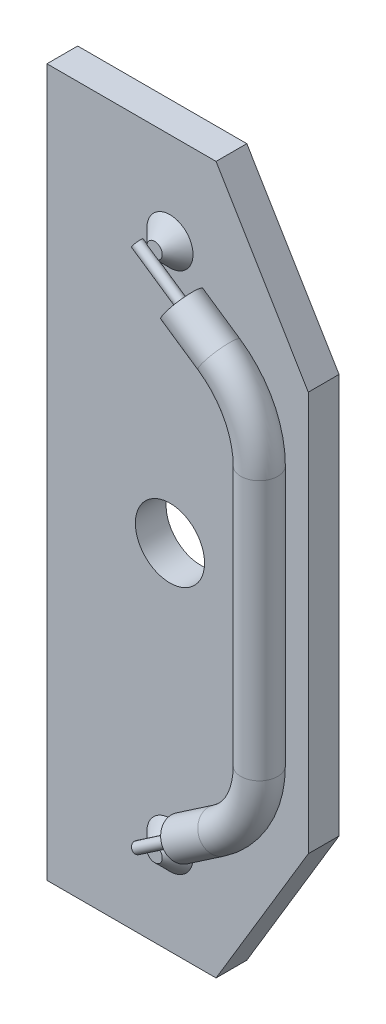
ISO-10303-21;
HEADER;
FILE_DESCRIPTION(('STEP AP214'),'2;1');
FILE_NAME('part.step','',(''),(''),'','','');
FILE_SCHEMA(('AUTOMOTIVE_DESIGN { 1 0 10303 214 1 1 1 1 }'));
ENDSEC;
DATA;
#1=APPLICATION_CONTEXT('core data for automotive mechanical design processes');
#2=APPLICATION_PROTOCOL_DEFINITION('international standard','automotive_design',2000,#1);
#3=PRODUCT_CONTEXT('',#1,'mechanical');
#4=PRODUCT('Part','Part','',(#3));
#5=PRODUCT_RELATED_PRODUCT_CATEGORY('part','',(#4));
#6=PRODUCT_DEFINITION_FORMATION('','',#4);
#7=PRODUCT_DEFINITION_CONTEXT('part definition',#1,'design');
#8=PRODUCT_DEFINITION('design','',#6,#7);
#9=PRODUCT_DEFINITION_SHAPE('','',#8);
#10=(LENGTH_UNIT() NAMED_UNIT(*) SI_UNIT(.MILLI.,.METRE.));
#11=(NAMED_UNIT(*) PLANE_ANGLE_UNIT() SI_UNIT($,.RADIAN.));
#12=(NAMED_UNIT(*) SI_UNIT($,.STERADIAN.) SOLID_ANGLE_UNIT());
#13=UNCERTAINTY_MEASURE_WITH_UNIT(LENGTH_MEASURE(1.E-05),#10,'distance_accuracy_value','');
#14=(GEOMETRIC_REPRESENTATION_CONTEXT(3) GLOBAL_UNCERTAINTY_ASSIGNED_CONTEXT((#13)) GLOBAL_UNIT_ASSIGNED_CONTEXT((#10,
#11,#12)) REPRESENTATION_CONTEXT('',''));
#15=CARTESIAN_POINT('',(0.,0.,0.));
#16=DIRECTION('',(0.,0.,1.));
#17=DIRECTION('',(1.,0.,0.));
#18=AXIS2_PLACEMENT_3D('',#15,#16,#17);
#19=CARTESIAN_POINT('',(0.,17.,2.00000000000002));
#20=DIRECTION('',(0.,0.,-1.));
#21=DIRECTION('',(1.,0.,0.));
#22=AXIS2_PLACEMENT_3D('',#19,#20,#21);
#23=CONICAL_SURFACE('',#22,1.5,0.78539816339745);
#24=CARTESIAN_POINT('',(0.,17.,2.00000000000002));
#25=DIRECTION('',(0.,0.,1.));
#26=DIRECTION('',(1.,0.,0.));
#27=AXIS2_PLACEMENT_3D('',#24,#25,#26);
#28=CIRCLE('',#27,1.5);
#29=CARTESIAN_POINT('',(1.50000000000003,17.,2.00000000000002));
#30=VERTEX_POINT('',#29);
#31=EDGE_CURVE('E365',#30,#30,#28,.T.);
#32=ORIENTED_EDGE('',*,*,#31,.T.);
#33=EDGE_LOOP('',(#32));
#34=FACE_BOUND('',#33,.T.);
#35=CARTESIAN_POINT('',(-0.495942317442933,17.0619778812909,3.00020000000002));
#36=CARTESIAN_POINT('',(-0.505048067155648,17.0606807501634,2.9913161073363));
#37=CARTESIAN_POINT('',(-0.51418508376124,17.0586686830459,2.98249000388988));
#38=CARTESIAN_POINT('',(-0.532331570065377,17.0529090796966,2.96506207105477));
#39=CARTESIAN_POINT('',(-0.541338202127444,17.049141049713,2.9564641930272));
#40=CARTESIAN_POINT('',(-0.557374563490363,17.0403626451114,2.94118396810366));
#41=CARTESIAN_POINT('',(-0.56448684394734,17.0356558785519,2.93441818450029));
#42=CARTESIAN_POINT('',(-0.578003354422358,17.0247105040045,2.92149792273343));
#43=CARTESIAN_POINT('',(-0.584410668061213,17.0184789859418,2.91534079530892));
#44=CARTESIAN_POINT('',(-0.595306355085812,17.005517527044,2.90469866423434));
#45=CARTESIAN_POINT('',(-0.599938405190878,16.9990015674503,2.90010130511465));
#46=CARTESIAN_POINT('',(-0.60823302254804,16.9849578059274,2.89162078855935));
#47=CARTESIAN_POINT('',(-0.611895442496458,16.9774298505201,2.88773773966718));
#48=CARTESIAN_POINT('',(-0.618088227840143,16.9615908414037,2.88076792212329));
#49=CARTESIAN_POINT('',(-0.620619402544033,16.9532803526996,2.8776805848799));
#50=CARTESIAN_POINT('',(-0.624506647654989,16.9361480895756,2.87229343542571));
#51=CARTESIAN_POINT('',(-0.62586202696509,16.9273260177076,2.86999408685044));
#52=CARTESIAN_POINT('',(-0.627699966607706,16.9065748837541,2.86549058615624));
#53=CARTESIAN_POINT('',(-0.627766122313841,16.8945525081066,2.86355083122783));
#54=CARTESIAN_POINT('',(-0.626205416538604,16.8705018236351,2.86065761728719));
#55=CARTESIAN_POINT('',(-0.624574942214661,16.8584735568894,2.8597062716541));
#56=CARTESIAN_POINT('',(-0.618622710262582,16.8280378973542,2.85819746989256));
#57=CARTESIAN_POINT('',(-0.613308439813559,16.8098036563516,2.8581534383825));
#58=CARTESIAN_POINT('',(-0.600195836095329,16.7742899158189,2.85904853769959));
#59=CARTESIAN_POINT('',(-0.592391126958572,16.7570130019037,2.85999020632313));
#60=CARTESIAN_POINT('',(-0.568409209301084,16.7110383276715,2.86320426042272));
#61=CARTESIAN_POINT('',(-0.550316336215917,16.6833771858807,2.86594559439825));
#62=CARTESIAN_POINT('',(-0.510226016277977,16.6310586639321,2.87122097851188));
#63=CARTESIAN_POINT('',(-0.488220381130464,16.6064077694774,2.87375457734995));
#64=CARTESIAN_POINT('',(-0.433136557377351,16.5520273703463,2.87844562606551));
#65=CARTESIAN_POINT('',(-0.39885450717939,16.523470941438,2.88017332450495));
#66=CARTESIAN_POINT('',(-0.326297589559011,16.4719278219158,2.88084757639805));
#67=CARTESIAN_POINT('',(-0.288021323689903,16.4489430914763,2.87979315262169));
#68=CARTESIAN_POINT('',(-0.216995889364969,16.413802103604,2.87589935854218));
#69=CARTESIAN_POINT('',(-0.184843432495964,16.4003788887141,2.87349569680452));
#70=CARTESIAN_POINT('',(-0.118966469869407,16.3784649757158,2.86812330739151));
#71=CARTESIAN_POINT('',(-0.0852473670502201,16.3699585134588,2.8651564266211));
#72=CARTESIAN_POINT('',(-0.0340782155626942,16.3621757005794,2.86149458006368));
#73=CARTESIAN_POINT('',(-0.0170320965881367,16.3604067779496,2.86040976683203));
#74=CARTESIAN_POINT('',(0.0171993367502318,16.3588227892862,2.85881978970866));
#75=CARTESIAN_POINT('',(0.0343846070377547,16.3590071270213,2.85831444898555));
#76=CARTESIAN_POINT('',(0.0653122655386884,16.3615194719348,2.85833794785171));
#77=CARTESIAN_POINT('',(0.079086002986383,16.3634318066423,2.85868788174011));
#78=CARTESIAN_POINT('',(0.106181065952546,16.369131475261,2.86040629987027));
#79=CARTESIAN_POINT('',(0.1195033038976,16.3729147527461,2.86177258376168));
#80=CARTESIAN_POINT('',(0.141502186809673,16.3812292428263,2.86533044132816));
#81=CARTESIAN_POINT('',(0.150426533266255,16.3852457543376,2.86717901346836));
#82=CARTESIAN_POINT('',(0.167451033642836,16.3943904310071,2.87173653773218));
#83=CARTESIAN_POINT('',(0.17555201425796,16.3995174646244,2.87444461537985));
#84=CARTESIAN_POINT('',(0.190653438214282,16.4108312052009,2.88081576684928));
#85=CARTESIAN_POINT('',(0.197646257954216,16.4170246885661,2.88448503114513));
#86=CARTESIAN_POINT('',(0.210186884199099,16.43021390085,2.89273668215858));
#87=CARTESIAN_POINT('',(0.215734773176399,16.4372095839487,2.89731901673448));
#88=CARTESIAN_POINT('',(0.224835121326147,16.4510292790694,2.90680712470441));
#89=CARTESIAN_POINT('',(0.228522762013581,16.4578114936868,2.91164605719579));
#90=CARTESIAN_POINT('',(0.234644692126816,16.4715565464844,2.92183052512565));
#91=CARTESIAN_POINT('',(0.237078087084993,16.4785195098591,2.92717641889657));
#92=CARTESIAN_POINT('',(0.241674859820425,16.4957429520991,2.94086207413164));
#93=CARTESIAN_POINT('',(0.243166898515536,16.5060063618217,2.94942254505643));
#94=CARTESIAN_POINT('',(0.244099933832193,16.5261884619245,2.96702965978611));
#95=CARTESIAN_POINT('',(0.24353785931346,16.5361066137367,2.97607701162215));
#96=CARTESIAN_POINT('',(0.241396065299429,16.5509776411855,2.99020523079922));
#97=CARTESIAN_POINT('',(0.240405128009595,16.5561111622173,2.99519133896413));
#98=CARTESIAN_POINT('',(0.239204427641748,16.5611591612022,3.00020000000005));
#99=B_SPLINE_CURVE_WITH_KNOTS('',3,(#35,#36,#37,#38,#39,#40,#41,#42,#43,#44,#45,#46,#47,#48,#49,
#50,#51,#52,#53,#54,#55,#56,#57,#58,#59,#60,#61,#62,#63,#64,#65,#66,#67,#68,#69,#70,#71,#72,#73,
#74,#75,#76,#77,#78,#79,#80,#81,#82,#83,#84,#85,#86,#87,#88,#89,#90,#91,#92,#93,#94,#95,#96,#97,
#98),.UNSPECIFIED.,.F.,.F.,(4,2,2,2,2,2,2,2,2,2,2,2,2,2,2,2,2,2,2,2,2,2,2,2,2,2,2,2,2,2,2,4),
(0.,0.038429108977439,0.0773184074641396,0.109853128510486,0.142239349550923,0.169781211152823,
0.197327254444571,0.22485355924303,0.252396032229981,0.288725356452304,0.325132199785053,
0.381789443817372,0.438592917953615,0.537539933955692,0.636696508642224,0.769988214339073,
0.903326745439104,1.00780673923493,1.11194986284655,1.1633804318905,1.21479530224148,
1.25640138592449,1.29791765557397,1.32768429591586,1.35742074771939,1.38735363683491,
1.41728481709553,1.44450620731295,1.47174698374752,1.51186417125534,1.55204136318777,
1.57369176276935),.UNSPECIFIED.);
#100=CARTESIAN_POINT('',(-0.496147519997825,17.0619486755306,3.00000000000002));
#101=VERTEX_POINT('',#100);
#102=CARTESIAN_POINT('',(0.239252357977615,16.5609575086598,3.00000000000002));
#103=VERTEX_POINT('',#102);
#104=EDGE_CURVE('E53',#101,#103,#99,.T.);
#105=ORIENTED_EDGE('',*,*,#104,.F.);
#106=CARTESIAN_POINT('',(0.,17.,3.00000000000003));
#107=DIRECTION('',(0.,0.,1.));
#108=DIRECTION('',(1.,0.,0.));
#109=AXIS2_PLACEMENT_3D('',#106,#107,#108);
#110=CIRCLE('',#109,0.499999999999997);
#111=EDGE_CURVE('E363',#103,#101,#110,.T.);
#112=ORIENTED_EDGE('',*,*,#111,.F.);
#113=EDGE_LOOP('',(#105,#112));
#114=FACE_BOUND('',#113,.T.);
#115=ADVANCED_FACE('F32',(#34,#114),#23,.T.);
#116=CARTESIAN_POINT('',(0.,17.,3.00000000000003));
#117=DIRECTION('',(0.,0.,1.));
#118=DIRECTION('',(1.,0.,0.));
#119=AXIS2_PLACEMENT_3D('',#116,#117,#118);
#120=PLANE('',#119);
#121=ORIENTED_EDGE('',*,*,#111,.T.);
#122=DIRECTION('',(0.826445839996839,-0.563016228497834,0.));
#123=VECTOR('',#122,1.);
#124=CARTESIAN_POINT('',(-0.777079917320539,17.2533338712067,3.00000000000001));
#125=LINE('',#124,#123);
#126=EDGE_CURVE('E218',#101,#103,#125,.T.);
#127=ORIENTED_EDGE('',*,*,#126,.T.);
#128=EDGE_LOOP('',(#121,#127));
#129=FACE_BOUND('',#128,.T.);
#130=ADVANCED_FACE('F194',(#129),#120,.T.);
#131=CARTESIAN_POINT('',(1.96241998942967,15.0581010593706,3.19000000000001));
#132=DIRECTION('',(-0.826445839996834,0.563016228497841,0.));
#133=DIRECTION('',(0.,0.,1.));
#134=AXIS2_PLACEMENT_3D('',#131,#132,#133);
#135=PLANE('',#134);
#136=CARTESIAN_POINT('',(1.96241998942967,15.0581010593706,3.19000000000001));
#137=DIRECTION('',(-0.826445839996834,0.563016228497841,0.));
#138=DIRECTION('',(0.,0.,1.));
#139=AXIS2_PLACEMENT_3D('',#136,#137,#138);
#140=CIRCLE('',#139,1.2);
#141=CARTESIAN_POINT('',(1.87537979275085,14.930335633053,2.00000000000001));
#142=VERTEX_POINT('',#141);
#143=CARTESIAN_POINT('',(2.04946018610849,15.1858664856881,2.00000000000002));
#144=VERTEX_POINT('',#143);
#145=EDGE_CURVE('E625',#142,#144,#140,.T.);
#146=ORIENTED_EDGE('',*,*,#145,.T.);
#147=DIRECTION('',(-0.563016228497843,-0.826445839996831,0.));
#148=VECTOR('',#147,1.);
#149=CARTESIAN_POINT('',(-5.6662130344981,3.86010762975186,2.00000000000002));
#150=LINE('',#149,#148);
#151=EDGE_CURVE('E281',#144,#142,#150,.T.);
#152=ORIENTED_EDGE('',*,*,#151,.T.);
#153=EDGE_LOOP('',(#146,#152));
#154=FACE_BOUND('',#153,.T.);
#155=CARTESIAN_POINT('',(1.96241998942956,15.0581010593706,3.19000000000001));
#156=DIRECTION('',(-0.826445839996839,0.563016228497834,0.));
#157=DIRECTION('',(-0.563016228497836,-0.826445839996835,0.));
#158=AXIS2_PLACEMENT_3D('',#155,#156,#157);
#159=CIRCLE('',#158,0.331672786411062);
#160=CARTESIAN_POINT('',(1.77568282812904,14.7839914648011,3.19000000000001));
#161=VERTEX_POINT('',#160);
#162=EDGE_CURVE('E355',#161,#161,#159,.T.);
#163=ORIENTED_EDGE('',*,*,#162,.F.);
#164=EDGE_LOOP('',(#163));
#165=FACE_BOUND('',#164,.T.);
#166=ADVANCED_FACE('F200',(#154,#165),#135,.T.);
#167=CARTESIAN_POINT('',(0.,0.,2.00000000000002));
#168=DIRECTION('',(0.,0.,1.));
#169=DIRECTION('',(1.,0.,0.));
#170=AXIS2_PLACEMENT_3D('',#167,#168,#169);
#171=PLANE('',#170);
#172=DIRECTION('',(0.,-1.,0.));
#173=VECTOR('',#172,1.);
#174=CARTESIAN_POINT('',(7.15459624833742,8.45374580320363,2.00000000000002));
#175=LINE('',#174,#173);
#176=CARTESIAN_POINT('',(7.15459624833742,8.45374580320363,2.00000000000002));
#177=VERTEX_POINT('',#176);
#178=CARTESIAN_POINT('',(7.15459624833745,-8.4537458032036,2.00000000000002));
#179=VERTEX_POINT('',#178);
#180=EDGE_CURVE('E321',#177,#179,#175,.T.);
#181=ORIENTED_EDGE('',*,*,#180,.T.);
#182=CARTESIAN_POINT('',(1.00000000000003,-8.45374580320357,2.00000000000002));
#183=DIRECTION('',(0.,0.,1.));
#184=DIRECTION('',(1.,0.,0.));
#185=AXIS2_PLACEMENT_3D('',#182,#183,#184);
#186=CIRCLE('',#185,6.1545962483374);
#187=CARTESIAN_POINT('',(4.46513756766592,-13.5401862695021,2.00000000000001));
#188=VERTEX_POINT('',#187);
#189=EDGE_CURVE('E40',#179,#188,#186,.F.);
#190=ORIENTED_EDGE('',*,*,#189,.T.);
#191=DIRECTION('',(-0.826445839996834,-0.563016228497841,0.));
#192=VECTOR('',#191,1.);
#193=CARTESIAN_POINT('',(4.46513756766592,-13.5401862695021,2.00000000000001));
#194=LINE('',#193,#192);
#195=CARTESIAN_POINT('',(2.04946018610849,-15.1858664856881,2.00000000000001));
#196=VERTEX_POINT('',#195);
#197=EDGE_CURVE('E307',#188,#196,#194,.T.);
#198=ORIENTED_EDGE('',*,*,#197,.T.);
#199=DIRECTION('',(0.563016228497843,-0.826445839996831,0.));
#200=VECTOR('',#199,1.);
#201=CARTESIAN_POINT('',(-5.66621303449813,-3.86010762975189,2.00000000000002));
#202=LINE('',#201,#200);
#203=CARTESIAN_POINT('',(1.87537979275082,-14.930335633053,2.00000000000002));
#204=VERTEX_POINT('',#203);
#205=EDGE_CURVE('E305',#204,#196,#202,.T.);
#206=ORIENTED_EDGE('',*,*,#205,.F.);
#207=DIRECTION('',(-0.826445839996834,-0.563016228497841,0.));
#208=VECTOR('',#207,1.);
#209=CARTESIAN_POINT('',(4.29105717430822,-13.284655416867,2.00000000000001));
#210=LINE('',#209,#208);
#211=CARTESIAN_POINT('',(4.29105717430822,-13.284655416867,2.00000000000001));
#212=VERTEX_POINT('',#211);
#213=EDGE_CURVE('E310',#204,#212,#210,.F.);
#214=ORIENTED_EDGE('',*,*,#213,.T.);
#215=CARTESIAN_POINT('',(1.00000000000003,-8.45374580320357,2.00000000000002));
#216=DIRECTION('',(0.,0.,-1.));
#217=DIRECTION('',(-1.,0.,0.));
#218=AXIS2_PLACEMENT_3D('',#215,#216,#217);
#219=CIRCLE('',#218,5.8454037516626);
#220=CARTESIAN_POINT('',(6.84540375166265,-8.4537458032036,2.00000000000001));
#221=VERTEX_POINT('',#220);
#222=EDGE_CURVE('E313',#212,#221,#219,.F.);
#223=ORIENTED_EDGE('',*,*,#222,.T.);
#224=DIRECTION('',(0.,-1.,0.));
#225=VECTOR('',#224,1.);
#226=CARTESIAN_POINT('',(6.84540375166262,8.45374580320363,2.00000000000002));
#227=LINE('',#226,#225);
#228=CARTESIAN_POINT('',(6.84540375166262,8.45374580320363,2.00000000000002));
#229=VERTEX_POINT('',#228);
#230=EDGE_CURVE('E329',#221,#229,#227,.F.);
#231=ORIENTED_EDGE('',*,*,#230,.T.);
#232=CARTESIAN_POINT('',(1.00000000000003,8.45374580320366,2.00000000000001));
#233=DIRECTION('',(0.,0.,-1.));
#234=DIRECTION('',(-1.,0.,0.));
#235=AXIS2_PLACEMENT_3D('',#232,#233,#234);
#236=CIRCLE('',#235,5.8454037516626);
#237=CARTESIAN_POINT('',(4.29105717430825,13.284655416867,2.00000000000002));
#238=VERTEX_POINT('',#237);
#239=EDGE_CURVE('E290',#238,#229,#236,.T.);
#240=ORIENTED_EDGE('',*,*,#239,.F.);
#241=DIRECTION('',(-0.826445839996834,0.563016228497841,0.));
#242=VECTOR('',#241,1.);
#243=CARTESIAN_POINT('',(4.29105717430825,13.284655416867,2.00000000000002));
#244=LINE('',#243,#242);
#245=EDGE_CURVE('E284',#142,#238,#244,.F.);
#246=ORIENTED_EDGE('',*,*,#245,.F.);
#247=ORIENTED_EDGE('',*,*,#151,.F.);
#248=DIRECTION('',(-0.826445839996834,0.563016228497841,0.));
#249=VECTOR('',#248,1.);
#250=CARTESIAN_POINT('',(4.46513756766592,13.5401862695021,2.00000000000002));
#251=LINE('',#250,#249);
#252=CARTESIAN_POINT('',(4.46513756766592,13.5401862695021,2.00000000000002));
#253=VERTEX_POINT('',#252);
#254=EDGE_CURVE('E287',#253,#144,#251,.T.);
#255=ORIENTED_EDGE('',*,*,#254,.F.);
#256=CARTESIAN_POINT('',(1.00000000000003,8.45374580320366,2.00000000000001));
#257=DIRECTION('',(0.,0.,1.));
#258=DIRECTION('',(1.,0.,0.));
#259=AXIS2_PLACEMENT_3D('',#256,#257,#258);
#260=CIRCLE('',#259,6.1545962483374);
#261=EDGE_CURVE('E293',#177,#253,#260,.T.);
#262=ORIENTED_EDGE('',*,*,#261,.F.);
#263=EDGE_LOOP('',(#181,#190,#198,#206,#214,#223,#231,#240,#246,#247,#255,#262));
#264=FACE_BOUND('',#263,.T.);
#265=CARTESIAN_POINT('',(0.,-17.,2.00000000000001));
#266=DIRECTION('',(0.,0.,1.));
#267=DIRECTION('',(1.,0.,0.));
#268=AXIS2_PLACEMENT_3D('',#265,#266,#267);
#269=CIRCLE('',#268,1.5);
#270=CARTESIAN_POINT('',(1.50000000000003,-17.,2.00000000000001));
#271=VERTEX_POINT('',#270);
#272=EDGE_CURVE('E296',#271,#271,#269,.T.);
#273=ORIENTED_EDGE('',*,*,#272,.F.);
#274=EDGE_LOOP('',(#273));
#275=FACE_BOUND('',#274,.T.);
#276=CARTESIAN_POINT('',(0.,0.,2.00000000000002));
#277=DIRECTION('',(0.,0.,-1.));
#278=DIRECTION('',(1.,0.,0.));
#279=AXIS2_PLACEMENT_3D('',#276,#277,#278);
#280=CIRCLE('',#279,2.25);
#281=CARTESIAN_POINT('',(2.25000000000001,0.,2.00000000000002));
#282=VERTEX_POINT('',#281);
#283=EDGE_CURVE('E390',#282,#282,#280,.T.);
#284=ORIENTED_EDGE('',*,*,#283,.T.);
#285=EDGE_LOOP('',(#284));
#286=FACE_BOUND('',#285,.T.);
#287=ORIENTED_EDGE('',*,*,#31,.F.);
#288=EDGE_LOOP('',(#287));
#289=FACE_BOUND('',#288,.T.);
#290=DIRECTION('',(0.,-1.,0.));
#291=VECTOR('',#290,1.);
#292=CARTESIAN_POINT('',(-8.00000000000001,22.9999999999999,2.00000000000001));
#293=LINE('',#292,#291);
#294=CARTESIAN_POINT('',(-8.00000000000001,22.9999999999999,2.00000000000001));
#295=VERTEX_POINT('',#294);
#296=CARTESIAN_POINT('',(-8.00000000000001,-23.0000000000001,2.00000000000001));
#297=VERTEX_POINT('',#296);
#298=EDGE_CURVE('E388',#295,#297,#293,.T.);
#299=ORIENTED_EDGE('',*,*,#298,.T.);
#300=DIRECTION('',(-1.,0.,0.));
#301=VECTOR('',#300,1.);
#302=CARTESIAN_POINT('',(-8.00000000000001,-23.0000000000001,2.00000000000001));
#303=LINE('',#302,#301);
#304=CARTESIAN_POINT('',(3.,-23.,2.00000000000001));
#305=VERTEX_POINT('',#304);
#306=EDGE_CURVE('E341',#305,#297,#303,.T.);
#307=ORIENTED_EDGE('',*,*,#306,.F.);
#308=DIRECTION('',(-0.514495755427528,-0.857492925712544,0.));
#309=VECTOR('',#308,1.);
#310=CARTESIAN_POINT('',(3.,-23.,2.00000000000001));
#311=LINE('',#310,#309);
#312=CARTESIAN_POINT('',(9.00000000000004,-13.,2.00000000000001));
#313=VERTEX_POINT('',#312);
#314=EDGE_CURVE('E344',#313,#305,#311,.T.);
#315=ORIENTED_EDGE('',*,*,#314,.F.);
#316=DIRECTION('',(0.,1.,0.));
#317=VECTOR('',#316,1.);
#318=CARTESIAN_POINT('',(9.00000000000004,13.,2.));
#319=LINE('',#318,#317);
#320=CARTESIAN_POINT('',(9.00000000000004,13.,2.));
#321=VERTEX_POINT('',#320);
#322=EDGE_CURVE('E381',#313,#321,#319,.T.);
#323=ORIENTED_EDGE('',*,*,#322,.T.);
#324=DIRECTION('',(-0.514495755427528,0.857492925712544,0.));
#325=VECTOR('',#324,1.);
#326=CARTESIAN_POINT('',(3.00000000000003,23.,2.));
#327=LINE('',#326,#325);
#328=CARTESIAN_POINT('',(3.00000000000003,23.,2.));
#329=VERTEX_POINT('',#328);
#330=EDGE_CURVE('E384',#321,#329,#327,.T.);
#331=ORIENTED_EDGE('',*,*,#330,.T.);
#332=DIRECTION('',(-1.,0.,0.));
#333=VECTOR('',#332,1.);
#334=CARTESIAN_POINT('',(-8.00000000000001,22.9999999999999,2.00000000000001));
#335=LINE('',#334,#333);
#336=EDGE_CURVE('E386',#329,#295,#335,.T.);
#337=ORIENTED_EDGE('',*,*,#336,.T.);
#338=EDGE_LOOP('',(#299,#307,#315,#323,#331,#337));
#339=FACE_BOUND('',#338,.T.);
#340=ADVANCED_FACE('F232',(#264,#275,#286,#289,#339),#171,.T.);
#341=CARTESIAN_POINT('',(0.,0.,0.));
#342=DIRECTION('',(0.,0.,1.));
#343=DIRECTION('',(1.,0.,0.));
#344=AXIS2_PLACEMENT_3D('',#341,#342,#343);
#345=PLANE('',#344);
#346=CARTESIAN_POINT('',(0.,-17.,0.));
#347=DIRECTION('',(0.,0.,1.));
#348=DIRECTION('',(-1.,0.,0.));
#349=AXIS2_PLACEMENT_3D('',#346,#347,#348);
#350=CIRCLE('',#349,2.);
#351=CARTESIAN_POINT('',(-1.99999999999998,-17.,0.));
#352=VERTEX_POINT('',#351);
#353=EDGE_CURVE('E136',#352,#352,#350,.T.);
#354=ORIENTED_EDGE('',*,*,#353,.T.);
#355=EDGE_LOOP('',(#354));
#356=FACE_BOUND('',#355,.T.);
#357=CARTESIAN_POINT('',(0.,0.,0.));
#358=DIRECTION('',(0.,0.,-1.));
#359=DIRECTION('',(1.,0.,0.));
#360=AXIS2_PLACEMENT_3D('',#357,#358,#359);
#361=CIRCLE('',#360,2.25);
#362=CARTESIAN_POINT('',(2.25000000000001,0.,0.));
#363=VERTEX_POINT('',#362);
#364=EDGE_CURVE('E378',#363,#363,#361,.T.);
#365=ORIENTED_EDGE('',*,*,#364,.F.);
#366=EDGE_LOOP('',(#365));
#367=FACE_BOUND('',#366,.T.);
#368=DIRECTION('',(0.,1.,0.));
#369=VECTOR('',#368,1.);
#370=CARTESIAN_POINT('',(9.00000000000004,13.,0.));
#371=LINE('',#370,#369);
#372=CARTESIAN_POINT('',(9.00000000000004,-13.,0.));
#373=VERTEX_POINT('',#372);
#374=CARTESIAN_POINT('',(9.00000000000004,13.,0.));
#375=VERTEX_POINT('',#374);
#376=EDGE_CURVE('E364',#373,#375,#371,.T.);
#377=ORIENTED_EDGE('',*,*,#376,.F.);
#378=DIRECTION('',(-0.514495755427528,-0.857492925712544,0.));
#379=VECTOR('',#378,1.);
#380=CARTESIAN_POINT('',(2.99999999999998,-23.0000000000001,0.));
#381=LINE('',#380,#379);
#382=CARTESIAN_POINT('',(2.99999999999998,-23.0000000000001,0.));
#383=VERTEX_POINT('',#382);
#384=EDGE_CURVE('E338',#373,#383,#381,.T.);
#385=ORIENTED_EDGE('',*,*,#384,.T.);
#386=DIRECTION('',(-1.,0.,0.));
#387=VECTOR('',#386,1.);
#388=CARTESIAN_POINT('',(-8.00000000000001,-23.0000000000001,0.));
#389=LINE('',#388,#387);
#390=CARTESIAN_POINT('',(-8.00000000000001,-23.0000000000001,0.));
#391=VERTEX_POINT('',#390);
#392=EDGE_CURVE('E135',#383,#391,#389,.T.);
#393=ORIENTED_EDGE('',*,*,#392,.T.);
#394=DIRECTION('',(0.,-1.,0.));
#395=VECTOR('',#394,1.);
#396=CARTESIAN_POINT('',(-8.00000000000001,23.,0.));
#397=LINE('',#396,#395);
#398=CARTESIAN_POINT('',(-8.00000000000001,23.,0.));
#399=VERTEX_POINT('',#398);
#400=EDGE_CURVE('E376',#399,#391,#397,.T.);
#401=ORIENTED_EDGE('',*,*,#400,.F.);
#402=DIRECTION('',(-1.,0.,0.));
#403=VECTOR('',#402,1.);
#404=CARTESIAN_POINT('',(-8.00000000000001,23.,0.));
#405=LINE('',#404,#403);
#406=CARTESIAN_POINT('',(3.,23.,0.));
#407=VERTEX_POINT('',#406);
#408=EDGE_CURVE('E374',#407,#399,#405,.T.);
#409=ORIENTED_EDGE('',*,*,#408,.F.);
#410=DIRECTION('',(-0.514495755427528,0.857492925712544,0.));
#411=VECTOR('',#410,1.);
#412=CARTESIAN_POINT('',(3.,23.,0.));
#413=LINE('',#412,#411);
#414=EDGE_CURVE('E368',#375,#407,#413,.T.);
#415=ORIENTED_EDGE('',*,*,#414,.F.);
#416=EDGE_LOOP('',(#377,#385,#393,#401,#409,#415));
#417=FACE_BOUND('',#416,.T.);
#418=CARTESIAN_POINT('',(0.,16.9999999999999,0.));
#419=DIRECTION('',(0.,0.,1.));
#420=DIRECTION('',(1.,0.,0.));
#421=AXIS2_PLACEMENT_3D('',#418,#419,#420);
#422=CIRCLE('',#421,2.);
#423=CARTESIAN_POINT('',(2.00000000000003,16.9999999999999,0.));
#424=VERTEX_POINT('',#423);
#425=EDGE_CURVE('E268',#424,#424,#422,.F.);
#426=ORIENTED_EDGE('',*,*,#425,.F.);
#427=EDGE_LOOP('',(#426));
#428=FACE_BOUND('',#427,.T.);
#429=ADVANCED_FACE('F208',(#356,#367,#417,#428),#345,.F.);
#430=CARTESIAN_POINT('',(9.00000000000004,13.,2.));
#431=DIRECTION('',(-1.,0.,0.));
#432=DIRECTION('',(0.,-1.,0.));
#433=AXIS2_PLACEMENT_3D('',#430,#431,#432);
#434=PLANE('',#433);
#435=ORIENTED_EDGE('',*,*,#376,.T.);
#436=DIRECTION('',(0.,0.,-1.));
#437=VECTOR('',#436,1.);
#438=CARTESIAN_POINT('',(9.00000000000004,13.,2.));
#439=LINE('',#438,#437);
#440=EDGE_CURVE('E271',#321,#375,#439,.T.);
#441=ORIENTED_EDGE('',*,*,#440,.F.);
#442=ORIENTED_EDGE('',*,*,#322,.F.);
#443=DIRECTION('',(0.,0.,-1.));
#444=VECTOR('',#443,1.);
#445=CARTESIAN_POINT('',(9.00000000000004,-13.,2.00000000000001));
#446=LINE('',#445,#444);
#447=EDGE_CURVE('E347',#313,#373,#446,.T.);
#448=ORIENTED_EDGE('',*,*,#447,.T.);
#449=EDGE_LOOP('',(#435,#441,#442,#448));
#450=FACE_BOUND('',#449,.T.);
#451=ADVANCED_FACE('F34',(#450),#434,.F.);
#452=CARTESIAN_POINT('',(3.00000000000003,23.,2.));
#453=DIRECTION('',(-0.857492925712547,-0.514495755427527,0.));
#454=DIRECTION('',(0.514495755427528,-0.857492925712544,0.));
#455=AXIS2_PLACEMENT_3D('',#452,#453,#454);
#456=PLANE('',#455);
#457=ORIENTED_EDGE('',*,*,#414,.T.);
#458=DIRECTION('',(0.,0.,-1.));
#459=VECTOR('',#458,1.);
#460=CARTESIAN_POINT('',(3.00000000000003,23.,2.));
#461=LINE('',#460,#459);
#462=EDGE_CURVE('E276',#329,#407,#461,.T.);
#463=ORIENTED_EDGE('',*,*,#462,.F.);
#464=ORIENTED_EDGE('',*,*,#330,.F.);
#465=ORIENTED_EDGE('',*,*,#440,.T.);
#466=EDGE_LOOP('',(#457,#463,#464,#465));
#467=FACE_BOUND('',#466,.T.);
#468=ADVANCED_FACE('F419',(#467),#456,.F.);
#469=CARTESIAN_POINT('',(-8.00000000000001,22.9999999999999,2.00000000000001));
#470=DIRECTION('',(0.,-1.,0.));
#471=DIRECTION('',(0.,0.,-1.));
#472=AXIS2_PLACEMENT_3D('',#469,#470,#471);
#473=PLANE('',#472);
#474=ORIENTED_EDGE('',*,*,#408,.T.);
#475=DIRECTION('',(0.,0.,-1.));
#476=VECTOR('',#475,1.);
#477=CARTESIAN_POINT('',(-8.00000000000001,22.9999999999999,2.00000000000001));
#478=LINE('',#477,#476);
#479=EDGE_CURVE('E393',#295,#399,#478,.T.);
#480=ORIENTED_EDGE('',*,*,#479,.F.);
#481=ORIENTED_EDGE('',*,*,#336,.F.);
#482=ORIENTED_EDGE('',*,*,#462,.T.);
#483=EDGE_LOOP('',(#474,#480,#481,#482));
#484=FACE_BOUND('',#483,.T.);
#485=ADVANCED_FACE('F400',(#484),#473,.F.);
#486=CARTESIAN_POINT('',(-8.00000000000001,22.9999999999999,2.00000000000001));
#487=DIRECTION('',(1.,0.,0.));
#488=DIRECTION('',(0.,1.,0.));
#489=AXIS2_PLACEMENT_3D('',#486,#487,#488);
#490=PLANE('',#489);
#491=ORIENTED_EDGE('',*,*,#400,.T.);
#492=DIRECTION('',(0.,0.,-1.));
#493=VECTOR('',#492,1.);
#494=CARTESIAN_POINT('',(-8.00000000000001,-23.0000000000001,2.00000000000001));
#495=LINE('',#494,#493);
#496=EDGE_CURVE('E352',#297,#391,#495,.T.);
#497=ORIENTED_EDGE('',*,*,#496,.F.);
#498=ORIENTED_EDGE('',*,*,#298,.F.);
#499=ORIENTED_EDGE('',*,*,#479,.T.);
#500=EDGE_LOOP('',(#491,#497,#498,#499));
#501=FACE_BOUND('',#500,.T.);
#502=ADVANCED_FACE('F259',(#501),#490,.F.);
#503=CARTESIAN_POINT('',(0.,0.,2.00000000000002));
#504=DIRECTION('',(0.,0.,-1.));
#505=DIRECTION('',(-1.,0.,0.));
#506=AXIS2_PLACEMENT_3D('',#503,#504,#505);
#507=CYLINDRICAL_SURFACE('',#506,2.25);
#508=ORIENTED_EDGE('',*,*,#364,.T.);
#509=EDGE_LOOP('',(#508));
#510=FACE_BOUND('',#509,.T.);
#511=ORIENTED_EDGE('',*,*,#283,.F.);
#512=EDGE_LOOP('',(#511));
#513=FACE_BOUND('',#512,.T.);
#514=ADVANCED_FACE('F254',(#510,#513),#507,.F.);
#515=CARTESIAN_POINT('',(0.,17.,-3.));
#516=DIRECTION('',(0.,0.,1.));
#517=DIRECTION('',(1.,0.,0.));
#518=AXIS2_PLACEMENT_3D('',#515,#516,#517);
#519=CYLINDRICAL_SURFACE('',#518,2.);
#520=CARTESIAN_POINT('',(0.,17.,-1.49999999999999));
#521=DIRECTION('',(0.,0.,-1.));
#522=DIRECTION('',(-1.,0.,0.));
#523=AXIS2_PLACEMENT_3D('',#520,#521,#522);
#524=CIRCLE('',#523,2.);
#525=CARTESIAN_POINT('',(2.00000000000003,17.,-1.49999999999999));
#526=VERTEX_POINT('',#525);
#527=EDGE_CURVE('E265',#526,#526,#524,.F.);
#528=ORIENTED_EDGE('',*,*,#527,.T.);
#529=EDGE_LOOP('',(#528));
#530=FACE_BOUND('',#529,.T.);
#531=ORIENTED_EDGE('',*,*,#425,.T.);
#532=EDGE_LOOP('',(#531));
#533=FACE_BOUND('',#532,.T.);
#534=ADVANCED_FACE('F251',(#530,#533),#519,.T.);
#535=CARTESIAN_POINT('',(0.,17.,-3.));
#536=DIRECTION('',(0.,0.,-1.));
#537=DIRECTION('',(-1.,0.,0.));
#538=AXIS2_PLACEMENT_3D('',#535,#536,#537);
#539=PLANE('',#538);
#540=CARTESIAN_POINT('',(0.,17.,-3.));
#541=DIRECTION('',(0.,0.,-1.));
#542=DIRECTION('',(-1.,0.,0.));
#543=AXIS2_PLACEMENT_3D('',#540,#541,#542);
#544=CIRCLE('',#543,0.500000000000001);
#545=CARTESIAN_POINT('',(0.50000000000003,17.,-3.));
#546=VERTEX_POINT('',#545);
#547=EDGE_CURVE('E270',#546,#546,#544,.T.);
#548=ORIENTED_EDGE('',*,*,#547,.T.);
#549=EDGE_LOOP('',(#548));
#550=FACE_BOUND('',#549,.T.);
#551=ADVANCED_FACE('F248',(#550),#539,.T.);
#552=CARTESIAN_POINT('',(0.,17.,-3.));
#553=DIRECTION('',(0.,0.,1.));
#554=DIRECTION('',(1.,0.,0.));
#555=AXIS2_PLACEMENT_3D('',#552,#553,#554);
#556=CONICAL_SURFACE('',#555,0.500000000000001,0.785398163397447);
#557=CARTESIAN_POINT('',(2.00000000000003,17.,-1.49999999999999));
#558=CARTESIAN_POINT('',(1.98437500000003,17.,-1.515625));
#559=CARTESIAN_POINT('',(1.96875000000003,17.,-1.53125));
#560=CARTESIAN_POINT('',(1.93750000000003,17.,-1.5625));
#561=CARTESIAN_POINT('',(1.92187500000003,17.,-1.578125));
#562=CARTESIAN_POINT('',(1.89062500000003,17.,-1.609375));
#563=CARTESIAN_POINT('',(1.87500000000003,17.,-1.625));
#564=CARTESIAN_POINT('',(1.84375000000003,17.,-1.65625));
#565=CARTESIAN_POINT('',(1.82812500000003,17.,-1.671875));
#566=CARTESIAN_POINT('',(1.79687500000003,17.,-1.703125));
#567=CARTESIAN_POINT('',(1.78125000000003,17.,-1.71875));
#568=CARTESIAN_POINT('',(1.75000000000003,17.,-1.75));
#569=CARTESIAN_POINT('',(1.73437500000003,17.,-1.765625));
#570=CARTESIAN_POINT('',(1.70312500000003,17.,-1.796875));
#571=CARTESIAN_POINT('',(1.68750000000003,17.,-1.8125));
#572=CARTESIAN_POINT('',(1.65625000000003,17.,-1.84375));
#573=CARTESIAN_POINT('',(1.64062500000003,17.,-1.859375));
#574=CARTESIAN_POINT('',(1.60937500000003,17.,-1.890625));
#575=CARTESIAN_POINT('',(1.59375000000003,17.,-1.90625));
#576=CARTESIAN_POINT('',(1.56250000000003,17.,-1.9375));
#577=CARTESIAN_POINT('',(1.54687500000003,17.,-1.953125));
#578=CARTESIAN_POINT('',(1.51562500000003,17.,-1.984375));
#579=CARTESIAN_POINT('',(1.50000000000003,17.,-2.));
#580=CARTESIAN_POINT('',(1.46875000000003,17.,-2.03125));
#581=CARTESIAN_POINT('',(1.45312500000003,17.,-2.046875));
#582=CARTESIAN_POINT('',(1.42187500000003,17.,-2.078125));
#583=CARTESIAN_POINT('',(1.40625000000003,17.,-2.09375));
#584=CARTESIAN_POINT('',(1.37500000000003,17.,-2.125));
#585=CARTESIAN_POINT('',(1.35937500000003,17.,-2.140625));
#586=CARTESIAN_POINT('',(1.32812500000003,17.,-2.171875));
#587=CARTESIAN_POINT('',(1.31250000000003,17.,-2.1875));
#588=CARTESIAN_POINT('',(1.28125000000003,17.,-2.21875));
#589=CARTESIAN_POINT('',(1.26562500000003,17.,-2.234375));
#590=CARTESIAN_POINT('',(1.23437500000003,17.,-2.265625));
#591=CARTESIAN_POINT('',(1.21875000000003,17.,-2.28125));
#592=CARTESIAN_POINT('',(1.18750000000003,17.,-2.3125));
#593=CARTESIAN_POINT('',(1.17187500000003,17.,-2.328125));
#594=CARTESIAN_POINT('',(1.14062500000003,17.,-2.359375));
#595=CARTESIAN_POINT('',(1.12500000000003,17.,-2.375));
#596=CARTESIAN_POINT('',(1.09375000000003,17.,-2.40625));
#597=CARTESIAN_POINT('',(1.07812500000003,17.,-2.421875));
#598=CARTESIAN_POINT('',(1.04687500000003,17.,-2.453125));
#599=CARTESIAN_POINT('',(1.03125000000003,17.,-2.46875));
#600=CARTESIAN_POINT('',(1.00000000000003,17.,-2.5));
#601=CARTESIAN_POINT('',(0.984375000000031,17.,-2.515625));
#602=CARTESIAN_POINT('',(0.953125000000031,17.,-2.546875));
#603=CARTESIAN_POINT('',(0.937500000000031,17.,-2.5625));
#604=CARTESIAN_POINT('',(0.906250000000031,17.,-2.59375));
#605=CARTESIAN_POINT('',(0.890625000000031,17.,-2.609375));
#606=CARTESIAN_POINT('',(0.859375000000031,17.,-2.640625));
#607=CARTESIAN_POINT('',(0.843750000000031,17.,-2.65625));
#608=CARTESIAN_POINT('',(0.812500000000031,17.,-2.6875));
#609=CARTESIAN_POINT('',(0.796875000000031,17.,-2.703125));
#610=CARTESIAN_POINT('',(0.765625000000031,17.,-2.734375));
#611=CARTESIAN_POINT('',(0.750000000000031,17.,-2.75));
#612=CARTESIAN_POINT('',(0.718750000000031,17.,-2.78125));
#613=CARTESIAN_POINT('',(0.703125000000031,17.,-2.796875));
#614=CARTESIAN_POINT('',(0.67187500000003,17.,-2.828125));
#615=CARTESIAN_POINT('',(0.65625000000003,17.,-2.84375));
#616=CARTESIAN_POINT('',(0.62500000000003,17.,-2.875));
#617=CARTESIAN_POINT('',(0.60937500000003,17.,-2.890625));
#618=CARTESIAN_POINT('',(0.57812500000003,17.,-2.921875));
#619=CARTESIAN_POINT('',(0.56250000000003,17.,-2.9375));
#620=CARTESIAN_POINT('',(0.53125000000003,17.,-2.96875));
#621=CARTESIAN_POINT('',(0.51562500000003,17.,-2.984375));
#622=CARTESIAN_POINT('',(0.50000000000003,17.,-3.));
#623=B_SPLINE_CURVE_WITH_KNOTS('',3,(#557,#558,#559,#560,#561,#562,#563,#564,#565,#566,#567,
#568,#569,#570,#571,#572,#573,#574,#575,#576,#577,#578,#579,#580,#581,#582,#583,#584,#585,#586,
#587,#588,#589,#590,#591,#592,#593,#594,#595,#596,#597,#598,#599,#600,#601,#602,#603,#604,#605,
#606,#607,#608,#609,#610,#611,#612,#613,#614,#615,#616,#617,#618,#619,#620,#621,#622),
.UNSPECIFIED.,.F.,.F.,(4,2,2,2,2,2,2,2,2,2,2,2,2,2,2,2,2,2,2,2,2,2,2,2,2,2,2,2,2,2,2,2,4),(0.,
0.0662912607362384,0.132582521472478,0.198873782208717,0.265165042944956,0.331456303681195,
0.397747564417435,0.464038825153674,0.530330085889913,0.596621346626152,0.662912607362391,
0.72920386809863,0.795495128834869,0.861786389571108,0.928077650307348,0.994368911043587,
1.06066017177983,1.12695143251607,1.1932426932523,1.25953395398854,1.32582521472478,
1.39211647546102,1.45840773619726,1.5246989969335,1.59099025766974,1.65728151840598,
1.72357277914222,1.78986403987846,1.8561553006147,1.92244656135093,1.98873782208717,
2.05502908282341,2.12132034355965),.UNSPECIFIED.);
#624=EDGE_CURVE('BSEAM244',#526,#546,#623,.T.);
#625=ORIENTED_EDGE('',*,*,#527,.F.);
#626=ORIENTED_EDGE('',*,*,#547,.F.);
#627=ORIENTED_EDGE('',*,*,#624,.T.);
#628=ORIENTED_EDGE('',*,*,#624,.F.);
#629=EDGE_LOOP('',(#625,#627,#626,#628));
#630=FACE_BOUND('',#629,.T.);
#631=ADVANCED_FACE('F244',(#630),#556,.T.);
#632=CARTESIAN_POINT('',(4.37809737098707,13.4124208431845,3.19000000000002));
#633=DIRECTION('',(-0.826445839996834,0.563016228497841,0.));
#634=DIRECTION('',(-0.563016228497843,-0.826445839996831,0.));
#635=AXIS2_PLACEMENT_3D('',#632,#633,#634);
#636=CYLINDRICAL_SURFACE('',#635,1.2);
#637=CARTESIAN_POINT('',(4.37809737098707,13.4124208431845,3.19000000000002));
#638=DIRECTION('',(-0.826445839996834,0.563016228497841,0.));
#639=DIRECTION('',(0.,0.,1.));
#640=AXIS2_PLACEMENT_3D('',#637,#638,#639);
#641=CIRCLE('',#640,1.2);
#642=EDGE_CURVE('E624',#238,#253,#641,.T.);
#643=ORIENTED_EDGE('',*,*,#642,.T.);
#644=ORIENTED_EDGE('',*,*,#254,.T.);
#645=ORIENTED_EDGE('',*,*,#145,.F.);
#646=ORIENTED_EDGE('',*,*,#245,.T.);
#647=EDGE_LOOP('',(#643,#644,#645,#646));
#648=FACE_BOUND('',#647,.T.);
#649=ADVANCED_FACE('F240',(#648),#636,.T.);
#650=CARTESIAN_POINT('',(1.00000000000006,8.45374580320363,3.19000000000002));
#651=DIRECTION('',(0.,0.,1.));
#652=DIRECTION('',(1.,0.,0.));
#653=AXIS2_PLACEMENT_3D('',#650,#651,#652);
#654=TOROIDAL_SURFACE('',#653,6.,1.2);
#655=CARTESIAN_POINT('',(7.00000000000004,8.45374580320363,3.19000000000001));
#656=DIRECTION('',(0.,1.,0.));
#657=DIRECTION('',(0.,0.,1.));
#658=AXIS2_PLACEMENT_3D('',#655,#656,#657);
#659=CIRCLE('',#658,1.2);
#660=EDGE_CURVE('E217',#229,#177,#659,.T.);
#661=ORIENTED_EDGE('',*,*,#660,.T.);
#662=ORIENTED_EDGE('',*,*,#261,.T.);
#663=ORIENTED_EDGE('',*,*,#642,.F.);
#664=ORIENTED_EDGE('',*,*,#239,.T.);
#665=EDGE_LOOP('',(#661,#662,#663,#664));
#666=FACE_BOUND('',#665,.T.);
#667=ADVANCED_FACE('F236',(#666),#654,.T.);
#668=CARTESIAN_POINT('',(7.00000000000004,8.45374580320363,3.19000000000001));
#669=DIRECTION('',(0.,-1.,0.));
#670=DIRECTION('',(0.,0.,-1.));
#671=AXIS2_PLACEMENT_3D('',#668,#669,#670);
#672=CYLINDRICAL_SURFACE('',#671,1.2);
#673=ORIENTED_EDGE('',*,*,#230,.F.);
#674=CARTESIAN_POINT('',(7.00000000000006,-8.45374580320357,3.19000000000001));
#675=DIRECTION('',(0.,1.,0.));
#676=DIRECTION('',(0.,0.,1.));
#677=AXIS2_PLACEMENT_3D('',#674,#675,#676);
#678=CIRCLE('',#677,1.2);
#679=EDGE_CURVE('E142',#221,#179,#678,.T.);
#680=ORIENTED_EDGE('',*,*,#679,.T.);
#681=ORIENTED_EDGE('',*,*,#180,.F.);
#682=ORIENTED_EDGE('',*,*,#660,.F.);
#683=EDGE_LOOP('',(#673,#680,#681,#682));
#684=FACE_BOUND('',#683,.T.);
#685=ADVANCED_FACE('F227',(#684),#672,.T.);
#686=CARTESIAN_POINT('',(-0.930140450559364,17.028657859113,3.19000000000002));
#687=DIRECTION('',(0.826445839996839,-0.563016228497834,0.));
#688=DIRECTION('',(0.563016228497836,0.826445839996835,0.));
#689=AXIS2_PLACEMENT_3D('',#686,#687,#688);
#690=CYLINDRICAL_SURFACE('',#689,0.331672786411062);
#691=ORIENTED_EDGE('',*,*,#162,.T.);
#692=EDGE_LOOP('',(#691));
#693=FACE_BOUND('',#692,.T.);
#694=CARTESIAN_POINT('',(-0.930140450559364,17.028657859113,3.19000000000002));
#695=DIRECTION('',(-0.826445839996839,0.563016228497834,0.));
#696=DIRECTION('',(-0.563016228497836,-0.826445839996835,0.));
#697=AXIS2_PLACEMENT_3D('',#694,#695,#696);
#698=CIRCLE('',#697,0.331672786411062);
#699=CARTESIAN_POINT('',(-1.11687761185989,16.7545482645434,3.19000000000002));
#700=VERTEX_POINT('',#699);
#701=EDGE_CURVE('E357',#700,#700,#698,.T.);
#702=ORIENTED_EDGE('',*,*,#701,.F.);
#703=EDGE_LOOP('',(#702));
#704=FACE_BOUND('',#703,.T.);
#705=ORIENTED_EDGE('',*,*,#126,.F.);
#706=ORIENTED_EDGE('',*,*,#104,.T.);
#707=EDGE_LOOP('',(#705,#706));
#708=FACE_BOUND('',#707,.T.);
#709=ADVANCED_FACE('F221',(#693,#704,#708),#690,.T.);
#710=CARTESIAN_POINT('',(-0.930140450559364,17.028657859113,3.19000000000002));
#711=DIRECTION('',(-0.826445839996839,0.563016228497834,0.));
#712=DIRECTION('',(-0.563016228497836,-0.826445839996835,0.));
#713=AXIS2_PLACEMENT_3D('',#710,#711,#712);
#714=PLANE('',#713);
#715=ORIENTED_EDGE('',*,*,#701,.T.);
#716=EDGE_LOOP('',(#715));
#717=FACE_BOUND('',#716,.T.);
#718=ADVANCED_FACE('F226',(#717),#714,.T.);
#719=CARTESIAN_POINT('',(-8.00000000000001,-23.0000000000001,2.00000000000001));
#720=DIRECTION('',(0.,-1.,0.));
#721=DIRECTION('',(1.,0.,0.));
#722=AXIS2_PLACEMENT_3D('',#719,#720,#721);
#723=PLANE('',#722);
#724=ORIENTED_EDGE('',*,*,#392,.F.);
#725=DIRECTION('',(0.,0.,-1.));
#726=VECTOR('',#725,1.);
#727=CARTESIAN_POINT('',(3.,-23.,2.00000000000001));
#728=LINE('',#727,#726);
#729=EDGE_CURVE('E350',#305,#383,#728,.T.);
#730=ORIENTED_EDGE('',*,*,#729,.F.);
#731=ORIENTED_EDGE('',*,*,#306,.T.);
#732=ORIENTED_EDGE('',*,*,#496,.T.);
#733=EDGE_LOOP('',(#724,#730,#731,#732));
#734=FACE_BOUND('',#733,.T.);
#735=ADVANCED_FACE('F410',(#734),#723,.T.);
#736=CARTESIAN_POINT('',(3.,-23.,2.00000000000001));
#737=DIRECTION('',(0.857492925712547,-0.514495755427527,0.));
#738=DIRECTION('',(0.514495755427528,0.857492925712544,0.));
#739=AXIS2_PLACEMENT_3D('',#736,#737,#738);
#740=PLANE('',#739);
#741=ORIENTED_EDGE('',*,*,#384,.F.);
#742=ORIENTED_EDGE('',*,*,#447,.F.);
#743=ORIENTED_EDGE('',*,*,#314,.T.);
#744=ORIENTED_EDGE('',*,*,#729,.T.);
#745=EDGE_LOOP('',(#741,#742,#743,#744));
#746=FACE_BOUND('',#745,.T.);
#747=ADVANCED_FACE('F192',(#746),#740,.T.);
#748=CARTESIAN_POINT('',(0.,-17.,2.00000000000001));
#749=DIRECTION('',(0.,0.,-1.));
#750=DIRECTION('',(1.,0.,0.));
#751=AXIS2_PLACEMENT_3D('',#748,#749,#750);
#752=CONICAL_SURFACE('',#751,1.5,0.78539816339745);
#753=CARTESIAN_POINT('',(0.239204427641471,-16.5611591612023,3.00020000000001));
#754=CARTESIAN_POINT('',(0.24133024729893,-16.5522105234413,2.99131610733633));
#755=CARTESIAN_POINT('',(0.242802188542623,-16.542971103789,2.98249000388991));
#756=CARTESIAN_POINT('',(0.244084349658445,-16.5239757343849,2.96506207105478));
#757=CARTESIAN_POINT('',(0.24387445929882,-16.5142149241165,2.95646419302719));
#758=CARTESIAN_POINT('',(0.241574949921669,-16.4960782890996,2.94118396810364));
#759=CARTESIAN_POINT('',(0.239798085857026,-16.4877367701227,2.93441818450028));
#760=CARTESIAN_POINT('',(0.234559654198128,-16.4711519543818,2.92149792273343));
#761=CARTESIAN_POINT('',(0.231105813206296,-16.4629083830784,2.91534079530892));
#762=CARTESIAN_POINT('',(0.223031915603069,-16.4480245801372,2.90469866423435));
#763=CARTESIAN_POINT('',(0.218663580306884,-16.44132896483,2.90010130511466));
#764=CARTESIAN_POINT('',(0.208630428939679,-16.4284695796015,2.89162078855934));
#765=CARTESIAN_POINT('',(0.202965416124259,-16.4223058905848,2.88773773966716));
#766=CARTESIAN_POINT('',(0.190492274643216,-16.410745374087,2.88076792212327));
#767=CARTESIAN_POINT('',(0.183684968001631,-16.4053480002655,2.8776805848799));
#768=CARTESIAN_POINT('',(0.169164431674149,-16.3954596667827,2.87229343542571));
#769=CARTESIAN_POINT('',(0.161450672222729,-16.390969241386,2.86999408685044));
#770=CARTESIAN_POINT('',(0.142812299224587,-16.3816634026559,2.86549058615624));
#771=CARTESIAN_POINT('',(0.131648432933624,-16.3772013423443,2.86355083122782));
#772=CARTESIAN_POINT('',(0.108695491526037,-16.3698505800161,2.86065761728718));
#773=CARTESIAN_POINT('',(0.096905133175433,-16.36696525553,2.85970627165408));
#774=CARTESIAN_POINT('',(0.0664028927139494,-16.3613642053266,2.85819746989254));
#775=CARTESIAN_POINT('',(0.0474888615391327,-16.3596354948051,2.85815343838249));
#776=CARTESIAN_POINT('',(0.00964005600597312,-16.358839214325,2.85904853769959));
#777=CARTESIAN_POINT('',(-0.00929464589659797,-16.3597785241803,2.85999020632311));
#778=CARTESIAN_POINT('',(-0.0608568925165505,-16.3652683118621,2.8632042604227));
#779=CARTESIAN_POINT('',(-0.093220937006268,-16.3719809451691,2.86594559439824));
#780=CARTESIAN_POINT('',(-0.156582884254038,-16.3901392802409,2.87122097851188));
#781=CARTESIAN_POINT('',(-0.187577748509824,-16.4015949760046,2.87375457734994));
#782=CARTESIAN_POINT('',(-0.258346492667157,-16.4329516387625,2.87844562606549));
#783=CARTESIAN_POINT('',(-0.297469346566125,-16.4544023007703,2.88017332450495));
#784=CARTESIAN_POINT('',(-0.371993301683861,-16.5030580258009,2.88084757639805));
#785=CARTESIAN_POINT('',(-0.407393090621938,-16.5302651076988,2.87979315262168));
#786=CARTESIAN_POINT('',(-0.466092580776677,-16.5834992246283,2.87589935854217));
#787=CARTESIAN_POINT('',(-0.490352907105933,-16.6085072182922,2.87349569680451));
#788=CARTESIAN_POINT('',(-0.534858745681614,-16.6617915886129,2.8681233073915));
#789=CARTESIAN_POINT('',(-0.55511695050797,-16.6900571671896,2.8651564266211));
#790=CARTESIAN_POINT('',(-0.581088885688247,-16.7348267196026,2.86149458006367));
#791=CARTESIAN_POINT('',(-0.588974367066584,-16.7500424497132,2.86040976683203));
#792=CARTESIAN_POINT('',(-0.602978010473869,-16.7813186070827,2.85881978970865));
#793=CARTESIAN_POINT('',(-0.609096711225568,-16.7973787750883,2.85831444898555));
#794=CARTESIAN_POINT('',(-0.618079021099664,-16.8270797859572,2.85833794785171));
#795=CARTESIAN_POINT('',(-0.621340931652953,-16.8405976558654,2.85868788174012));
#796=CARTESIAN_POINT('',(-0.625954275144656,-16.8678986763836,2.86040629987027));
#797=CARTESIAN_POINT('',(-0.627309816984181,-16.8816811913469,2.86177258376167));
#798=CARTESIAN_POINT('',(-0.627624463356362,-16.905196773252,2.86533044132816));
#799=CARTESIAN_POINT('',(-0.627153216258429,-16.9149719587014,2.86717901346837));
#800=CARTESIAN_POINT('',(-0.624874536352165,-16.9341622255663,2.87173653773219));
#801=CARTESIAN_POINT('',(-0.623068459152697,-16.9435776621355,2.87444461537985));
#802=CARTESIAN_POINT('',(-0.618067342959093,-16.9617722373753,2.88081576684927));
#803=CARTESIAN_POINT('',(-0.614863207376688,-16.9705467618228,2.88448503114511));
#804=CARTESIAN_POINT('',(-0.607179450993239,-16.9870447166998,2.89273668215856));
#805=CARTESIAN_POINT('',(-0.602699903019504,-16.9947682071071,2.89731901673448));
#806=CARTESIAN_POINT('',(-0.593170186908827,-17.0082953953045,2.9068071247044));
#807=CARTESIAN_POINT('',(-0.588208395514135,-17.0142095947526,2.91164605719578));
#808=CARTESIAN_POINT('',(-0.577657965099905,-17.0249377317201,2.92183052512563));
#809=CARTESIAN_POINT('',(-0.572068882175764,-17.0297508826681,2.92717641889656));
#810=CARTESIAN_POINT('',(-0.557723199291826,-17.0403328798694,2.94086207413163));
#811=CARTESIAN_POINT('',(-0.548718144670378,-17.0454780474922,2.94942254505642));
#812=CARTESIAN_POINT('',(-0.530278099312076,-17.053733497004,2.96702965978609));
#813=CARTESIAN_POINT('',(-0.520842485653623,-17.0568407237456,2.97607701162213));
#814=CARTESIAN_POINT('',(-0.506219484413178,-17.0602907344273,2.99020523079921));
#815=CARTESIAN_POINT('',(-0.501079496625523,-17.0612475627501,2.99519133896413));
#816=CARTESIAN_POINT('',(-0.495942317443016,-17.0619778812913,3.00020000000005));
#817=B_SPLINE_CURVE_WITH_KNOTS('',3,(#753,#754,#755,#756,#757,#758,#759,#760,#761,#762,#763,
#764,#765,#766,#767,#768,#769,#770,#771,#772,#773,#774,#775,#776,#777,#778,#779,#780,#781,#782,
#783,#784,#785,#786,#787,#788,#789,#790,#791,#792,#793,#794,#795,#796,#797,#798,#799,#800,#801,
#802,#803,#804,#805,#806,#807,#808,#809,#810,#811,#812,#813,#814,#815,#816),.UNSPECIFIED.,.F.,
.F.,(4,2,2,2,2,2,2,2,2,2,2,2,2,2,2,2,2,2,2,2,2,2,2,2,2,2,2,2,2,2,2,4),(0.,0.0384291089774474,
0.0773184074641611,0.109853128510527,0.142239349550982,0.169781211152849,0.197327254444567,
0.22485355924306,0.25239603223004,0.28872535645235,0.325132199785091,0.381789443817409,
0.438592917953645,0.537539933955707,0.636696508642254,0.769988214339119,0.903326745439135,
1.00780673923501,1.1119498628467,1.16338043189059,1.21479530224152,1.25640138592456,
1.29791765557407,1.32768429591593,1.35742074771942,1.38735363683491,1.4172848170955,
1.44450620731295,1.47174698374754,1.51186417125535,1.55204136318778,1.57369176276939),.UNSPECIFIED.);
#818=CARTESIAN_POINT('',(0.239252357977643,-16.5609575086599,3.00000000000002));
#819=VERTEX_POINT('',#818);
#820=CARTESIAN_POINT('',(-0.496147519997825,-17.0619486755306,3.00000000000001));
#821=VERTEX_POINT('',#820);
#822=EDGE_CURVE('E138',#819,#821,#817,.T.);
#823=ORIENTED_EDGE('',*,*,#822,.F.);
#824=CARTESIAN_POINT('',(0.,-17.,3.00000000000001));
#825=DIRECTION('',(0.,0.,1.));
#826=DIRECTION('',(1.,0.,0.));
#827=AXIS2_PLACEMENT_3D('',#824,#825,#826);
#828=CIRCLE('',#827,0.499999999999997);
#829=EDGE_CURVE('E130',#819,#821,#828,.F.);
#830=ORIENTED_EDGE('',*,*,#829,.T.);
#831=EDGE_LOOP('',(#823,#830));
#832=FACE_BOUND('',#831,.T.);
#833=ORIENTED_EDGE('',*,*,#272,.T.);
#834=EDGE_LOOP('',(#833));
#835=FACE_BOUND('',#834,.T.);
#836=ADVANCED_FACE('F139',(#832,#835),#752,.T.);
#837=CARTESIAN_POINT('',(0.,-17.,3.00000000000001));
#838=DIRECTION('',(0.,0.,1.));
#839=DIRECTION('',(1.,0.,0.));
#840=AXIS2_PLACEMENT_3D('',#837,#838,#839);
#841=PLANE('',#840);
#842=DIRECTION('',(0.826445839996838,0.563016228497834,0.));
#843=VECTOR('',#842,1.);
#844=CARTESIAN_POINT('',(-0.777079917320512,-17.2533338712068,3.00000000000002));
#845=LINE('',#844,#843);
#846=EDGE_CURVE('E46',#821,#819,#845,.T.);
#847=ORIENTED_EDGE('',*,*,#846,.F.);
#848=ORIENTED_EDGE('',*,*,#829,.F.);
#849=EDGE_LOOP('',(#847,#848));
#850=FACE_BOUND('',#849,.T.);
#851=ADVANCED_FACE('F132',(#850),#841,.T.);
#852=CARTESIAN_POINT('',(0.,-17.0000000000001,-3.));
#853=DIRECTION('',(0.,0.,1.));
#854=DIRECTION('',(1.,0.,0.));
#855=AXIS2_PLACEMENT_3D('',#852,#853,#854);
#856=CYLINDRICAL_SURFACE('',#855,2.);
#857=CARTESIAN_POINT('',(0.,-17.,-1.49999999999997));
#858=DIRECTION('',(0.,0.,-1.));
#859=DIRECTION('',(-1.,0.,0.));
#860=AXIS2_PLACEMENT_3D('',#857,#858,#859);
#861=CIRCLE('',#860,2.);
#862=CARTESIAN_POINT('',(2.00000000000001,-17.,-1.49999999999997));
#863=VERTEX_POINT('',#862);
#864=EDGE_CURVE('E299',#863,#863,#861,.F.);
#865=ORIENTED_EDGE('',*,*,#864,.T.);
#866=EDGE_LOOP('',(#865));
#867=FACE_BOUND('',#866,.T.);
#868=ORIENTED_EDGE('',*,*,#353,.F.);
#869=EDGE_LOOP('',(#868));
#870=FACE_BOUND('',#869,.T.);
#871=ADVANCED_FACE('F184',(#867,#870),#856,.T.);
#872=CARTESIAN_POINT('',(0.,-17.0000000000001,-3.));
#873=DIRECTION('',(0.,0.,-1.));
#874=DIRECTION('',(-1.,0.,0.));
#875=AXIS2_PLACEMENT_3D('',#872,#873,#874);
#876=PLANE('',#875);
#877=CARTESIAN_POINT('',(0.,-17.0000000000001,-3.));
#878=DIRECTION('',(0.,0.,-1.));
#879=DIRECTION('',(-1.,0.,0.));
#880=AXIS2_PLACEMENT_3D('',#877,#878,#879);
#881=CIRCLE('',#880,0.49999999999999);
#882=CARTESIAN_POINT('',(0.499999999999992,-17.,-3.));
#883=VERTEX_POINT('',#882);
#884=EDGE_CURVE('E302',#883,#883,#881,.T.);
#885=ORIENTED_EDGE('',*,*,#884,.T.);
#886=EDGE_LOOP('',(#885));
#887=FACE_BOUND('',#886,.T.);
#888=ADVANCED_FACE('F180',(#887),#876,.T.);
#889=CARTESIAN_POINT('',(0.,-17.,-1.49999999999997));
#890=DIRECTION('',(0.,0.,1.));
#891=DIRECTION('',(1.,0.,0.));
#892=AXIS2_PLACEMENT_3D('',#889,#890,#891);
#893=CONICAL_SURFACE('',#892,2.,0.785398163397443);
#894=CARTESIAN_POINT('',(0.499999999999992,-17.,-3.));
#895=CARTESIAN_POINT('',(0.515624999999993,-17.,-2.984375));
#896=CARTESIAN_POINT('',(0.531249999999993,-17.,-2.96875));
#897=CARTESIAN_POINT('',(0.562499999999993,-17.,-2.9375));
#898=CARTESIAN_POINT('',(0.578124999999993,-17.,-2.921875));
#899=CARTESIAN_POINT('',(0.609374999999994,-17.,-2.890625));
#900=CARTESIAN_POINT('',(0.624999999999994,-17.,-2.875));
#901=CARTESIAN_POINT('',(0.656249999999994,-17.,-2.84375));
#902=CARTESIAN_POINT('',(0.671874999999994,-17.,-2.828125));
#903=CARTESIAN_POINT('',(0.703124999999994,-17.,-2.796875));
#904=CARTESIAN_POINT('',(0.718749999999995,-17.,-2.78125));
#905=CARTESIAN_POINT('',(0.749999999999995,-17.,-2.75));
#906=CARTESIAN_POINT('',(0.765624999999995,-17.,-2.734375));
#907=CARTESIAN_POINT('',(0.796874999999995,-17.,-2.703125));
#908=CARTESIAN_POINT('',(0.812499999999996,-17.,-2.6875));
#909=CARTESIAN_POINT('',(0.843749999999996,-17.,-2.65625));
#910=CARTESIAN_POINT('',(0.859374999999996,-17.,-2.640625));
#911=CARTESIAN_POINT('',(0.890624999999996,-17.,-2.609375));
#912=CARTESIAN_POINT('',(0.906249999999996,-17.,-2.59375));
#913=CARTESIAN_POINT('',(0.937499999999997,-17.,-2.5625));
#914=CARTESIAN_POINT('',(0.953124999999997,-17.,-2.54687499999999));
#915=CARTESIAN_POINT('',(0.984374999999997,-17.,-2.51562499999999));
#916=CARTESIAN_POINT('',(0.999999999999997,-17.,-2.49999999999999));
#917=CARTESIAN_POINT('',(1.03125,-17.,-2.46874999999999));
#918=CARTESIAN_POINT('',(1.046875,-17.,-2.45312499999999));
#919=CARTESIAN_POINT('',(1.078125,-17.,-2.42187499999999));
#920=CARTESIAN_POINT('',(1.09375,-17.,-2.40624999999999));
#921=CARTESIAN_POINT('',(1.125,-17.,-2.37499999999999));
#922=CARTESIAN_POINT('',(1.140625,-17.,-2.35937499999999));
#923=CARTESIAN_POINT('',(1.171875,-17.,-2.32812499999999));
#924=CARTESIAN_POINT('',(1.1875,-17.,-2.31249999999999));
#925=CARTESIAN_POINT('',(1.21875,-17.,-2.28124999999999));
#926=CARTESIAN_POINT('',(1.234375,-17.,-2.26562499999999));
#927=CARTESIAN_POINT('',(1.265625,-17.,-2.23437499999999));
#928=CARTESIAN_POINT('',(1.28125,-17.,-2.21874999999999));
#929=CARTESIAN_POINT('',(1.3125,-17.,-2.18749999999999));
#930=CARTESIAN_POINT('',(1.328125,-17.,-2.17187499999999));
#931=CARTESIAN_POINT('',(1.359375,-17.,-2.14062499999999));
#932=CARTESIAN_POINT('',(1.375,-17.,-2.12499999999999));
#933=CARTESIAN_POINT('',(1.40625,-17.,-2.09374999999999));
#934=CARTESIAN_POINT('',(1.421875,-17.,-2.07812499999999));
#935=CARTESIAN_POINT('',(1.453125,-17.,-2.04687499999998));
#936=CARTESIAN_POINT('',(1.46875,-17.,-2.03124999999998));
#937=CARTESIAN_POINT('',(1.5,-17.,-1.99999999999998));
#938=CARTESIAN_POINT('',(1.515625,-17.,-1.98437499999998));
#939=CARTESIAN_POINT('',(1.546875,-17.,-1.95312499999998));
#940=CARTESIAN_POINT('',(1.5625,-17.,-1.93749999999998));
#941=CARTESIAN_POINT('',(1.59375,-17.,-1.90624999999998));
#942=CARTESIAN_POINT('',(1.609375,-17.,-1.89062499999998));
#943=CARTESIAN_POINT('',(1.640625,-17.,-1.85937499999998));
#944=CARTESIAN_POINT('',(1.65625,-17.,-1.84374999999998));
#945=CARTESIAN_POINT('',(1.6875,-17.,-1.81249999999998));
#946=CARTESIAN_POINT('',(1.703125,-17.,-1.79687499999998));
#947=CARTESIAN_POINT('',(1.734375,-17.,-1.76562499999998));
#948=CARTESIAN_POINT('',(1.75,-17.,-1.74999999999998));
#949=CARTESIAN_POINT('',(1.78125,-17.,-1.71874999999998));
#950=CARTESIAN_POINT('',(1.796875,-17.,-1.70312499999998));
#951=CARTESIAN_POINT('',(1.82812500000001,-17.,-1.67187499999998));
#952=CARTESIAN_POINT('',(1.84375000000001,-17.,-1.65624999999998));
#953=CARTESIAN_POINT('',(1.87500000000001,-17.,-1.62499999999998));
#954=CARTESIAN_POINT('',(1.89062500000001,-17.,-1.60937499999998));
#955=CARTESIAN_POINT('',(1.92187500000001,-17.,-1.57812499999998));
#956=CARTESIAN_POINT('',(1.93750000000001,-17.,-1.56249999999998));
#957=CARTESIAN_POINT('',(1.96875000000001,-17.,-1.53124999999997));
#958=CARTESIAN_POINT('',(1.98437500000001,-17.,-1.51562499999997));
#959=CARTESIAN_POINT('',(2.00000000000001,-17.,-1.49999999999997));
#960=B_SPLINE_CURVE_WITH_KNOTS('',3,(#894,#895,#896,#897,#898,#899,#900,#901,#902,#903,#904,
#905,#906,#907,#908,#909,#910,#911,#912,#913,#914,#915,#916,#917,#918,#919,#920,#921,#922,#923,
#924,#925,#926,#927,#928,#929,#930,#931,#932,#933,#934,#935,#936,#937,#938,#939,#940,#941,#942,
#943,#944,#945,#946,#947,#948,#949,#950,#951,#952,#953,#954,#955,#956,#957,#958,#959),
.UNSPECIFIED.,.F.,.F.,(4,2,2,2,2,2,2,2,2,2,2,2,2,2,2,2,2,2,2,2,2,2,2,2,2,2,2,2,2,2,2,2,4),(0.,
0.0662912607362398,0.13258252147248,0.19887378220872,0.26516504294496,0.331456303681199,
0.397747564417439,0.464038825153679,0.530330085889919,0.596621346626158,0.662912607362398,
0.729203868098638,0.795495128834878,0.861786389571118,0.928077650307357,0.994368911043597,
1.06066017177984,1.12695143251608,1.19324269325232,1.25953395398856,1.3258252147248,
1.39211647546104,1.45840773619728,1.52469899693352,1.59099025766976,1.657281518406,
1.72357277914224,1.78986403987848,1.85615530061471,1.92244656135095,1.98873782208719,
2.05502908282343,2.12132034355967),.UNSPECIFIED.);
#961=EDGE_CURVE('BSEAM176',#883,#863,#960,.T.);
#962=ORIENTED_EDGE('',*,*,#884,.F.);
#963=ORIENTED_EDGE('',*,*,#864,.F.);
#964=ORIENTED_EDGE('',*,*,#961,.T.);
#965=ORIENTED_EDGE('',*,*,#961,.F.);
#966=EDGE_LOOP('',(#962,#964,#963,#965));
#967=FACE_BOUND('',#966,.T.);
#968=ADVANCED_FACE('F176',(#967),#893,.T.);
#969=CARTESIAN_POINT('',(4.37809737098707,-13.4124208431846,3.19000000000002));
#970=DIRECTION('',(-0.826445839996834,-0.563016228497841,0.));
#971=DIRECTION('',(0.563016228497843,-0.826445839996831,0.));
#972=AXIS2_PLACEMENT_3D('',#969,#970,#971);
#973=CYLINDRICAL_SURFACE('',#972,1.2);
#974=ORIENTED_EDGE('',*,*,#213,.F.);
#975=CARTESIAN_POINT('',(1.96241998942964,-15.0581010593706,3.19000000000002));
#976=DIRECTION('',(0.826445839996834,0.563016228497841,0.));
#977=DIRECTION('',(0.,0.,1.));
#978=AXIS2_PLACEMENT_3D('',#975,#976,#977);
#979=CIRCLE('',#978,1.2);
#980=EDGE_CURVE('E330',#204,#196,#979,.T.);
#981=ORIENTED_EDGE('',*,*,#980,.T.);
#982=ORIENTED_EDGE('',*,*,#197,.F.);
#983=CARTESIAN_POINT('',(4.37809737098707,-13.4124208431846,3.19000000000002));
#984=DIRECTION('',(0.826445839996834,0.563016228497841,0.));
#985=DIRECTION('',(0.,0.,1.));
#986=AXIS2_PLACEMENT_3D('',#983,#984,#985);
#987=CIRCLE('',#986,1.2);
#988=EDGE_CURVE('E326',#212,#188,#987,.T.);
#989=ORIENTED_EDGE('',*,*,#988,.F.);
#990=EDGE_LOOP('',(#974,#981,#982,#989));
#991=FACE_BOUND('',#990,.T.);
#992=ADVANCED_FACE('F172',(#991),#973,.T.);
#993=CARTESIAN_POINT('',(1.,-8.45374580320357,3.19000000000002));
#994=DIRECTION('',(0.,0.,-1.));
#995=DIRECTION('',(-1.,0.,0.));
#996=AXIS2_PLACEMENT_3D('',#993,#994,#995);
#997=TOROIDAL_SURFACE('',#996,6.,1.2);
#998=ORIENTED_EDGE('',*,*,#189,.F.);
#999=ORIENTED_EDGE('',*,*,#679,.F.);
#1000=ORIENTED_EDGE('',*,*,#222,.F.);
#1001=ORIENTED_EDGE('',*,*,#988,.T.);
#1002=EDGE_LOOP('',(#998,#999,#1000,#1001));
#1003=FACE_BOUND('',#1002,.T.);
#1004=ADVANCED_FACE('F168',(#1003),#997,.T.);
#1005=CARTESIAN_POINT('',(1.96241998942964,-15.0581010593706,3.19000000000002));
#1006=DIRECTION('',(-0.826445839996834,-0.563016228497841,0.));
#1007=DIRECTION('',(0.,0.,1.));
#1008=AXIS2_PLACEMENT_3D('',#1005,#1006,#1007);
#1009=PLANE('',#1008);
#1010=CARTESIAN_POINT('',(1.96241998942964,-15.0581010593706,3.19000000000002));
#1011=DIRECTION('',(-0.826445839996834,-0.563016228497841,0.));
#1012=DIRECTION('',(0.563016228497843,-0.826445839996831,0.));
#1013=AXIS2_PLACEMENT_3D('',#1010,#1011,#1012);
#1014=CIRCLE('',#1013,0.331672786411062);
#1015=CARTESIAN_POINT('',(2.14915715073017,-15.3322106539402,3.19000000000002));
#1016=VERTEX_POINT('',#1015);
#1017=EDGE_CURVE('E11',#1016,#1016,#1014,.T.);
#1018=ORIENTED_EDGE('',*,*,#1017,.F.);
#1019=EDGE_LOOP('',(#1018));
#1020=FACE_BOUND('',#1019,.T.);
#1021=ORIENTED_EDGE('',*,*,#980,.F.);
#1022=ORIENTED_EDGE('',*,*,#205,.T.);
#1023=EDGE_LOOP('',(#1021,#1022));
#1024=FACE_BOUND('',#1023,.T.);
#1025=ADVANCED_FACE('F165',(#1020,#1024),#1009,.T.);
#1026=CARTESIAN_POINT('',(-0.930140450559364,-17.028657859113,3.19000000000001));
#1027=DIRECTION('',(0.826445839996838,0.563016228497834,0.));
#1028=DIRECTION('',(-0.563016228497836,0.826445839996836,0.));
#1029=AXIS2_PLACEMENT_3D('',#1026,#1027,#1028);
#1030=CYLINDRICAL_SURFACE('',#1029,0.331672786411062);
#1031=ORIENTED_EDGE('',*,*,#846,.T.);
#1032=ORIENTED_EDGE('',*,*,#822,.T.);
#1033=EDGE_LOOP('',(#1031,#1032));
#1034=FACE_BOUND('',#1033,.T.);
#1035=CARTESIAN_POINT('',(-0.930140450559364,-17.028657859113,3.19000000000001));
#1036=DIRECTION('',(0.826445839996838,0.563016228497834,0.));
#1037=DIRECTION('',(-0.563016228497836,0.826445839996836,0.));
#1038=AXIS2_PLACEMENT_3D('',#1035,#1036,#1037);
#1039=CIRCLE('',#1038,0.331672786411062);
#1040=CARTESIAN_POINT('',(-1.11687761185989,-16.7545482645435,3.19000000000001));
#1041=VERTEX_POINT('',#1040);
#1042=EDGE_CURVE('E146',#1041,#1041,#1039,.T.);
#1043=ORIENTED_EDGE('',*,*,#1042,.T.);
#1044=EDGE_LOOP('',(#1043));
#1045=FACE_BOUND('',#1044,.T.);
#1046=ORIENTED_EDGE('',*,*,#1017,.T.);
#1047=EDGE_LOOP('',(#1046));
#1048=FACE_BOUND('',#1047,.T.);
#1049=ADVANCED_FACE('F144',(#1034,#1045,#1048),#1030,.T.);
#1050=CARTESIAN_POINT('',(-0.930140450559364,-17.028657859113,3.19000000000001));
#1051=DIRECTION('',(-0.826445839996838,-0.563016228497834,0.));
#1052=DIRECTION('',(-0.563016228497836,0.826445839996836,0.));
#1053=AXIS2_PLACEMENT_3D('',#1050,#1051,#1052);
#1054=PLANE('',#1053);
#1055=ORIENTED_EDGE('',*,*,#1042,.F.);
#1056=EDGE_LOOP('',(#1055));
#1057=FACE_BOUND('',#1056,.T.);
#1058=ADVANCED_FACE('F164',(#1057),#1054,.T.);
#1059=CLOSED_SHELL('',(#115,#130,#166,#340,#429,#451,#468,#485,#502,#514,#534,#551,#631,#649,
#667,#685,#709,#718,#735,#747,#836,#851,#871,#888,#968,#992,#1004,#1025,#1049,#1058));
#1060=MANIFOLD_SOLID_BREP('B2',#1059);
#1061=ADVANCED_BREP_SHAPE_REPRESENTATION('',(#18,#1060),#14);
#1062=SHAPE_DEFINITION_REPRESENTATION(#9,#1061);
ENDSEC;
END-ISO-10303-21;
